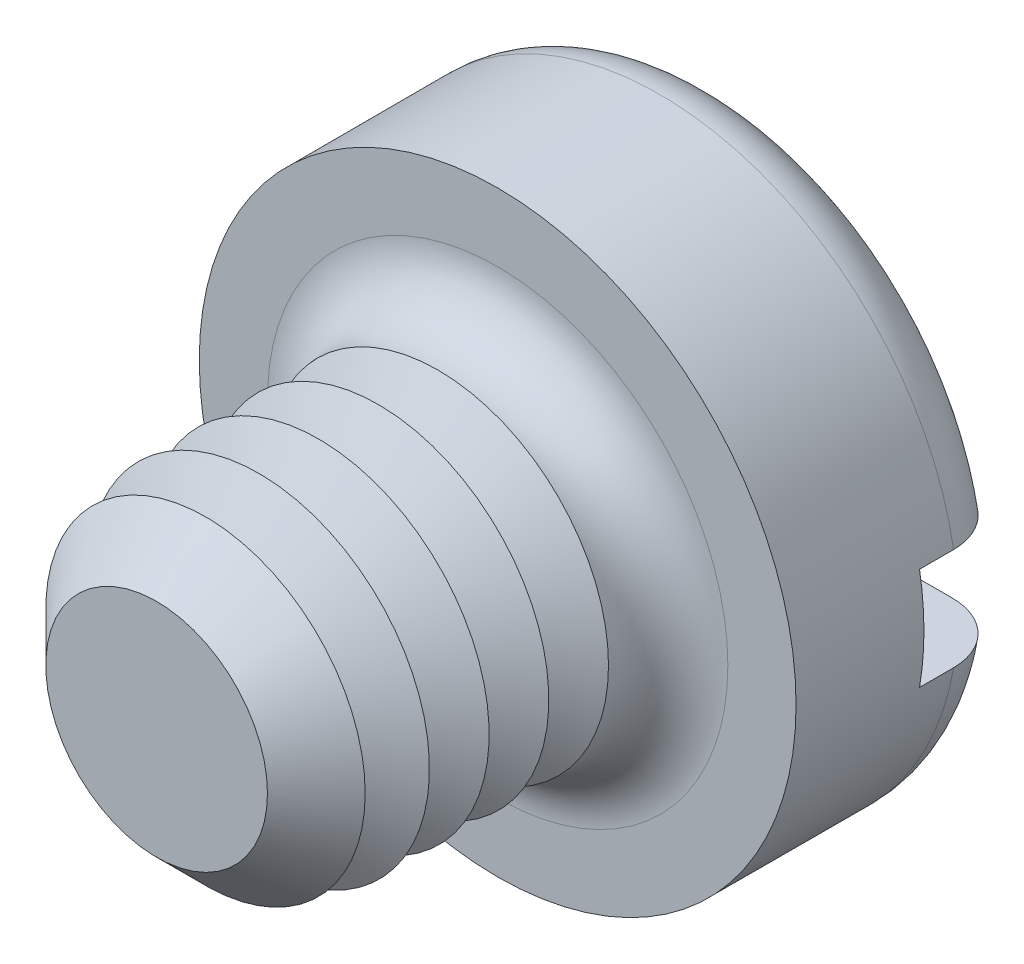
ISO-10303-21;
HEADER;
FILE_DESCRIPTION(('STEP AP214'),'2;1');
FILE_NAME('part.step','',(''),(''),'','','');
FILE_SCHEMA(('AUTOMOTIVE_DESIGN { 1 0 10303 214 1 1 1 1 }'));
ENDSEC;
DATA;
#1=APPLICATION_CONTEXT('core data for automotive mechanical design processes');
#2=APPLICATION_PROTOCOL_DEFINITION('international standard','automotive_design',2000,#1);
#3=PRODUCT_CONTEXT('',#1,'mechanical');
#4=PRODUCT('Part','Part','',(#3));
#5=PRODUCT_RELATED_PRODUCT_CATEGORY('part','',(#4));
#6=PRODUCT_DEFINITION_FORMATION('','',#4);
#7=PRODUCT_DEFINITION_CONTEXT('part definition',#1,'design');
#8=PRODUCT_DEFINITION('design','',#6,#7);
#9=PRODUCT_DEFINITION_SHAPE('','',#8);
#10=(LENGTH_UNIT() NAMED_UNIT(*) SI_UNIT(.MILLI.,.METRE.));
#11=(NAMED_UNIT(*) PLANE_ANGLE_UNIT() SI_UNIT($,.RADIAN.));
#12=(NAMED_UNIT(*) SI_UNIT($,.STERADIAN.) SOLID_ANGLE_UNIT());
#13=UNCERTAINTY_MEASURE_WITH_UNIT(LENGTH_MEASURE(1.E-05),#10,'distance_accuracy_value','');
#14=(GEOMETRIC_REPRESENTATION_CONTEXT(3) GLOBAL_UNCERTAINTY_ASSIGNED_CONTEXT((#13)) GLOBAL_UNIT_ASSIGNED_CONTEXT((#10,
#11,#12)) REPRESENTATION_CONTEXT('',''));
#15=CARTESIAN_POINT('',(0.,0.,0.));
#16=DIRECTION('',(0.,0.,1.));
#17=DIRECTION('',(1.,0.,0.));
#18=AXIS2_PLACEMENT_3D('',#15,#16,#17);
#19=CARTESIAN_POINT('',(0.,0.,-2.6));
#20=DIRECTION('',(0.,0.,1.));
#21=DIRECTION('',(1.,0.,0.));
#22=AXIS2_PLACEMENT_3D('',#19,#20,#21);
#23=PLANE('',#22);
#24=CARTESIAN_POINT('',(0.,0.,-2.6));
#25=DIRECTION('',(0.,0.,1.));
#26=DIRECTION('',(1.,0.,0.));
#27=AXIS2_PLACEMENT_3D('',#24,#25,#26);
#28=CIRCLE('',#27,2.8);
#29=CARTESIAN_POINT('',(-2.73495886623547,0.6,-2.6));
#30=VERTEX_POINT('',#29);
#31=CARTESIAN_POINT('',(2.73495886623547,0.6,-2.6));
#32=VERTEX_POINT('',#31);
#33=EDGE_CURVE('E116',#30,#32,#28,.F.);
#34=ORIENTED_EDGE('',*,*,#33,.T.);
#35=DIRECTION('',(1.,0.,0.));
#36=VECTOR('',#35,1.);
#37=CARTESIAN_POINT('',(-3.5,0.6,-2.6));
#38=LINE('',#37,#36);
#39=EDGE_CURVE('E111',#30,#32,#38,.T.);
#40=ORIENTED_EDGE('',*,*,#39,.F.);
#41=EDGE_LOOP('',(#34,#40));
#42=FACE_BOUND('',#41,.T.);
#43=ADVANCED_FACE('F39',(#42),#23,.F.);
#44=CARTESIAN_POINT('',(0.,0.,-1.9));
#45=DIRECTION('',(0.,0.,1.));
#46=DIRECTION('',(1.,0.,0.));
#47=AXIS2_PLACEMENT_3D('',#44,#45,#46);
#48=TOROIDAL_SURFACE('',#47,2.8,0.7);
#49=CARTESIAN_POINT('',(-3.24550494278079,0.6,-2.38938679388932));
#50=CARTESIAN_POINT('',(-3.21724139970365,0.6,-2.41780774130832));
#51=CARTESIAN_POINT('',(-3.18652103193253,0.6,-2.44383169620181));
#52=CARTESIAN_POINT('',(-3.12110229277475,0.6,-2.49034599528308));
#53=CARTESIAN_POINT('',(-3.08639834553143,0.6,-2.51082844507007));
#54=CARTESIAN_POINT('',(-3.01410013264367,0.6,-2.54568075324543));
#55=CARTESIAN_POINT('',(-2.97650963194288,0.6,-2.56005841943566));
#56=CARTESIAN_POINT('',(-2.89948250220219,0.6,-2.58239238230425));
#57=CARTESIAN_POINT('',(-2.86004633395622,0.6,-2.59035027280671));
#58=CARTESIAN_POINT('',(-2.77983715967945,0.6,-2.5997577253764));
#59=CARTESIAN_POINT('',(-2.73905311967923,0.6,-2.60111317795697));
#60=CARTESIAN_POINT('',(-2.65781876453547,0.6,-2.59706866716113));
#61=CARTESIAN_POINT('',(-2.61736849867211,0.6,-2.59166772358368));
#62=CARTESIAN_POINT('',(-2.53729983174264,0.6,-2.57414594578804));
#63=CARTESIAN_POINT('',(-2.49770360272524,0.6,-2.56192363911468));
#64=CARTESIAN_POINT('',(-2.421111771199,0.6,-2.5310238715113));
#65=CARTESIAN_POINT('',(-2.38411632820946,0.6,-2.51234601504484));
#66=CARTESIAN_POINT('',(-2.31371213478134,0.6,-2.46896762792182));
#67=CARTESIAN_POINT('',(-2.28031240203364,0.6,-2.44425244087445));
#68=CARTESIAN_POINT('',(-2.21823311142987,0.6,-2.38946667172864));
#69=CARTESIAN_POINT('',(-2.18955321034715,0.6,-2.35939647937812));
#70=CARTESIAN_POINT('',(-2.13836074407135,0.6,-2.29532787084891));
#71=CARTESIAN_POINT('',(-2.11574147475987,0.6,-2.26141482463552));
#72=CARTESIAN_POINT('',(-2.07677080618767,0.6,-2.19015935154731));
#73=CARTESIAN_POINT('',(-2.06041784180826,0.6,-2.15281778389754));
#74=CARTESIAN_POINT('',(-2.03508596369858,0.6,-2.07723332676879));
#75=CARTESIAN_POINT('',(-2.02585871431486,0.6,-2.03907365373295));
#76=CARTESIAN_POINT('',(-2.01416722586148,0.6,-1.96173417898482));
#77=CARTESIAN_POINT('',(-2.01170151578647,0.6,-1.92255460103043));
#78=CARTESIAN_POINT('',(-2.01359934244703,0.6,-1.84555709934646));
#79=CARTESIAN_POINT('',(-2.01775787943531,0.6,-1.80773393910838));
#80=CARTESIAN_POINT('',(-2.03236373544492,0.6,-1.73332511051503));
#81=CARTESIAN_POINT('',(-2.04281097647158,0.6,-1.69673942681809));
#82=CARTESIAN_POINT('',(-2.06962963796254,0.6,-1.62577336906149));
#83=CARTESIAN_POINT('',(-2.08600685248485,0.6,-1.59139519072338));
#84=CARTESIAN_POINT('',(-2.12413495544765,0.6,-1.52576356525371));
#85=CARTESIAN_POINT('',(-2.14588657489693,0.6,-1.49451054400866));
#86=CARTESIAN_POINT('',(-2.19483541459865,0.6,-1.43498643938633));
#87=CARTESIAN_POINT('',(-2.22217844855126,0.6,-1.40683532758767));
#88=CARTESIAN_POINT('',(-2.28105616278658,0.6,-1.35532544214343));
#89=CARTESIAN_POINT('',(-2.3125916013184,0.6,-1.33196753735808));
#90=CARTESIAN_POINT('',(-2.38018779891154,0.6,-1.28984356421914));
#91=CARTESIAN_POINT('',(-2.41637068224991,0.6,-1.27127330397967));
#92=CARTESIAN_POINT('',(-2.49129688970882,0.6,-1.24032971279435));
#93=CARTESIAN_POINT('',(-2.53004053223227,0.6,-1.22795715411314));
#94=CARTESIAN_POINT('',(-2.6098393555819,0.6,-1.2095515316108));
#95=CARTESIAN_POINT('',(-2.65092550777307,0.6,-1.20365237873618));
#96=CARTESIAN_POINT('',(-2.7335069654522,0.6,-1.1988380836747));
#97=CARTESIAN_POINT('',(-2.7750022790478,0.6,-1.19992308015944));
#98=CARTESIAN_POINT('',(-2.85718851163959,0.6,-1.20909046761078));
#99=CARTESIAN_POINT('',(-2.8978799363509,0.6,-1.21716830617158));
#100=CARTESIAN_POINT('',(-2.97729176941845,0.6,-1.24014327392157));
#101=CARTESIAN_POINT('',(-3.01601231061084,0.6,-1.25503994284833));
#102=CARTESIAN_POINT('',(-3.08976822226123,0.6,-1.29101066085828));
#103=CARTESIAN_POINT('',(-3.12484927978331,0.6,-1.31199098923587));
#104=CARTESIAN_POINT('',(-3.19090022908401,0.6,-1.35965144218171));
#105=CARTESIAN_POINT('',(-3.22187053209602,0.6,-1.38633099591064));
#106=CARTESIAN_POINT('',(-3.2781946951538,0.6,-1.44408564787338));
#107=CARTESIAN_POINT('',(-3.3036441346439,0.6,-1.47506754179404));
#108=CARTESIAN_POINT('',(-3.34887649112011,0.6,-1.54092398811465));
#109=CARTESIAN_POINT('',(-3.36865993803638,0.6,-1.57579817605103));
#110=CARTESIAN_POINT('',(-3.40166738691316,0.6,-1.64783067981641));
#111=CARTESIAN_POINT('',(-3.41499360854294,0.6,-1.68494217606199));
#112=CARTESIAN_POINT('',(-3.43515375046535,0.6,-1.76088675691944));
#113=CARTESIAN_POINT('',(-3.44198836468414,0.6,-1.79971965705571));
#114=CARTESIAN_POINT('',(-3.44891916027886,0.6,-1.87757893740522));
#115=CARTESIAN_POINT('',(-3.44908375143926,0.6,-1.91659924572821));
#116=CARTESIAN_POINT('',(-3.44284111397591,0.6,-1.99412088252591));
#117=CARTESIAN_POINT('',(-3.43643236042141,0.6,-2.03262208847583));
#118=CARTESIAN_POINT('',(-3.41725803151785,0.6,-2.10792315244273));
#119=CARTESIAN_POINT('',(-3.40450469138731,0.6,-2.14472613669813));
#120=CARTESIAN_POINT('',(-3.3730385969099,0.6,-2.21565060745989));
#121=CARTESIAN_POINT('',(-3.35433321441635,0.6,-2.24977534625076));
#122=CARTESIAN_POINT('',(-3.3201892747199,0.6,-2.30136364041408));
#123=CARTESIAN_POINT('',(-3.30647805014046,0.6,-2.31999402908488));
#124=CARTESIAN_POINT('',(-3.27728518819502,0.6,-2.35581090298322));
#125=CARTESIAN_POINT('',(-3.26180356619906,0.6,-2.37299740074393));
#126=CARTESIAN_POINT('',(-3.24550494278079,0.6,-2.38938679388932));
#127=B_SPLINE_CURVE_WITH_KNOTS('',3,(#49,#50,#51,#52,#53,#54,#55,#56,#57,#58,#59,#60,#61,#62,
#63,#64,#65,#66,#67,#68,#69,#70,#71,#72,#73,#74,#75,#76,#77,#78,#79,#80,#81,#82,#83,#84,#85,#86,
#87,#88,#89,#90,#91,#92,#93,#94,#95,#96,#97,#98,#99,#100,#101,#102,#103,#104,#105,#106,#107,
#108,#109,#110,#111,#112,#113,#114,#115,#116,#117,#118,#119,#120,#121,#122,#123,#124,#125,#126),
.UNSPECIFIED.,.T.,.F.,(4,2,2,2,2,2,2,2,2,2,2,2,2,2,2,2,2,2,2,2,2,2,2,2,2,2,2,2,2,2,2,2,2,2,2,2,
2,2,4),(0.,0.120160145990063,0.240490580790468,0.36066665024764,0.480812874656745,
0.602666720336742,0.724538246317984,0.848272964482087,0.972015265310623,1.09606100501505,
1.2200977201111,1.34178071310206,1.46343329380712,1.58062647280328,1.6977941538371,
1.81140573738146,1.92501591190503,2.03873739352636,2.15247435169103,2.26967910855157,
2.38690509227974,2.50835551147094,2.62982106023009,2.75375450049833,2.87769040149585,
3.00154567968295,3.12539259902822,3.24742469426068,3.36944457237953,3.48914477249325,
3.60883377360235,3.72656056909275,3.84427477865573,3.96078136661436,4.07731498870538,
4.19362474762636,4.3097910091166,4.37908387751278,4.44837614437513),.UNSPECIFIED.);
#128=CARTESIAN_POINT('',(-3.44818792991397,0.6,-1.8999999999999));
#129=VERTEX_POINT('',#128);
#130=EDGE_CURVE('E216',#129,#30,#127,.T.);
#131=ORIENTED_EDGE('',*,*,#130,.F.);
#132=CARTESIAN_POINT('',(0.,0.,-1.9));
#133=DIRECTION('',(0.,0.,1.));
#134=DIRECTION('',(1.,0.,0.));
#135=AXIS2_PLACEMENT_3D('',#132,#133,#134);
#136=CIRCLE('',#135,3.5);
#137=CARTESIAN_POINT('',(3.44818792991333,0.6,-1.9));
#138=VERTEX_POINT('',#137);
#139=EDGE_CURVE('E124',#138,#129,#136,.T.);
#140=ORIENTED_EDGE('',*,*,#139,.F.);
#141=CARTESIAN_POINT('',(2.1414268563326,0.6,-2.29762171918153));
#142=CARTESIAN_POINT('',(2.16505443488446,0.6,-2.33058245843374));
#143=CARTESIAN_POINT('',(2.19155609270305,0.6,-2.36152717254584));
#144=CARTESIAN_POINT('',(2.24942944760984,0.6,-2.41852964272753));
#145=CARTESIAN_POINT('',(2.28080921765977,0.6,-2.44457913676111));
#146=CARTESIAN_POINT('',(2.34741203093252,0.6,-2.49105381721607));
#147=CARTESIAN_POINT('',(2.38262862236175,0.6,-2.51148824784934));
#148=CARTESIAN_POINT('',(2.45593176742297,0.6,-2.54626881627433));
#149=CARTESIAN_POINT('',(2.49401741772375,0.6,-2.56061686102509));
#150=CARTESIAN_POINT('',(2.57272605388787,0.6,-2.58306429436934));
#151=CARTESIAN_POINT('',(2.6133821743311,0.6,-2.59104769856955));
#152=CARTESIAN_POINT('',(2.6954618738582,0.6,-2.60009608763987));
#153=CARTESIAN_POINT('',(2.73688552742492,0.6,-2.60116039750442));
#154=CARTESIAN_POINT('',(2.81941950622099,0.6,-2.5962925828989));
#155=CARTESIAN_POINT('',(2.86052888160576,0.6,-2.59034422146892));
#156=CARTESIAN_POINT('',(2.94113709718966,0.6,-2.57153687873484));
#157=CARTESIAN_POINT('',(2.98063603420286,0.6,-2.55867831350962));
#158=CARTESIAN_POINT('',(3.05633735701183,0.6,-2.52657771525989));
#159=CARTESIAN_POINT('',(3.09257627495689,0.6,-2.50742188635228));
#160=CARTESIAN_POINT('',(3.16123898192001,0.6,-2.46318606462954));
#161=CARTESIAN_POINT('',(3.19366316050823,0.6,-2.4381066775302));
#162=CARTESIAN_POINT('',(3.25312278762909,0.6,-2.38324481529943));
#163=CARTESIAN_POINT('',(3.28024842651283,0.6,-2.35356008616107));
#164=CARTESIAN_POINT('',(3.32902587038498,0.6,-2.28998971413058));
#165=CARTESIAN_POINT('',(3.35067820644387,0.6,-2.25610447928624));
#166=CARTESIAN_POINT('',(3.38751207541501,0.6,-2.18572286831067));
#167=CARTESIAN_POINT('',(3.40279804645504,0.6,-2.14928112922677));
#168=CARTESIAN_POINT('',(3.42695590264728,0.6,-2.07433042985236));
#169=CARTESIAN_POINT('',(3.43582824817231,0.6,-2.03582161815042));
#170=CARTESIAN_POINT('',(3.44682113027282,0.6,-1.95829536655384));
#171=CARTESIAN_POINT('',(3.44901648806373,0.6,-1.91928851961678));
#172=CARTESIAN_POINT('',(3.44680085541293,0.6,-1.84146366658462));
#173=CARTESIAN_POINT('',(3.44239008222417,0.6,-1.80264565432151));
#174=CARTESIAN_POINT('',(3.42712544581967,0.6,-1.72644634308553));
#175=CARTESIAN_POINT('',(3.41629508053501,0.6,-1.6890603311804));
#176=CARTESIAN_POINT('',(3.38853757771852,0.6,-1.61662604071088));
#177=CARTESIAN_POINT('',(3.37161039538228,0.6,-1.58157777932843));
#178=CARTESIAN_POINT('',(3.33207798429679,0.6,-1.51464178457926));
#179=CARTESIAN_POINT('',(3.30944854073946,0.6,-1.48276835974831));
#180=CARTESIAN_POINT('',(3.2592165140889,0.6,-1.42321861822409));
#181=CARTESIAN_POINT('',(3.23161370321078,0.6,-1.3955424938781));
#182=CARTESIAN_POINT('',(3.17188519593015,0.6,-1.34481834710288));
#183=CARTESIAN_POINT('',(3.13971065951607,0.6,-1.32182785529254));
#184=CARTESIAN_POINT('',(3.07201123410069,0.6,-1.28147003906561));
#185=CARTESIAN_POINT('',(3.03648608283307,0.6,-1.26410315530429));
#186=CARTESIAN_POINT('',(2.962449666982,0.6,-1.2351645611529));
#187=CARTESIAN_POINT('',(2.92389781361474,0.6,-1.22369671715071));
#188=CARTESIAN_POINT('',(2.84543273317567,0.6,-1.20726565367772));
#189=CARTESIAN_POINT('',(2.80551936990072,0.6,-1.20230308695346));
#190=CARTESIAN_POINT('',(2.72467191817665,0.6,-1.1989357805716));
#191=CARTESIAN_POINT('',(2.68373266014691,0.6,-1.20065484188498));
#192=CARTESIAN_POINT('',(2.60270222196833,0.6,-1.21084560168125));
#193=CARTESIAN_POINT('',(2.56261112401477,0.6,-1.21931795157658));
#194=CARTESIAN_POINT('',(2.48385954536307,0.6,-1.24292934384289));
#195=CARTESIAN_POINT('',(2.44522508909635,0.6,-1.25815531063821));
#196=CARTESIAN_POINT('',(2.37106165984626,0.6,-1.29488663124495));
#197=CARTESIAN_POINT('',(2.33553282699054,0.6,-1.31639226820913));
#198=CARTESIAN_POINT('',(2.2686996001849,0.6,-1.36507949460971));
#199=CARTESIAN_POINT('',(2.23738745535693,0.6,-1.39225042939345));
#200=CARTESIAN_POINT('',(2.17990424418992,0.6,-1.45157941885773));
#201=CARTESIAN_POINT('',(2.15373259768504,0.6,-1.48373691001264));
#202=CARTESIAN_POINT('',(2.10799355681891,0.6,-1.551327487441));
#203=CARTESIAN_POINT('',(2.08828258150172,0.6,-1.58666329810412));
#204=CARTESIAN_POINT('',(2.05534440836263,0.6,-1.66023600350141));
#205=CARTESIAN_POINT('',(2.042115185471,0.6,-1.6984719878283));
#206=CARTESIAN_POINT('',(2.02303126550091,0.6,-1.77519783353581));
#207=CARTESIAN_POINT('',(2.01691541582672,0.6,-1.8136228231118));
#208=CARTESIAN_POINT('',(2.01140375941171,0.6,-1.89096056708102));
#209=CARTESIAN_POINT('',(2.01200856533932,0.6,-1.92987336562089));
#210=CARTESIAN_POINT('',(2.01981617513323,0.6,-2.006065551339));
#211=CARTESIAN_POINT('',(2.02685835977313,0.6,-2.04336165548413));
#212=CARTESIAN_POINT('',(2.0470502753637,0.6,-2.1162250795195));
#213=CARTESIAN_POINT('',(2.06019252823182,0.6,-2.15179445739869));
#214=CARTESIAN_POINT('',(2.08525738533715,0.6,-2.20558874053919));
#215=CARTESIAN_POINT('',(2.09529161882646,0.6,-2.22471751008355));
#216=CARTESIAN_POINT('',(2.11708813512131,0.6,-2.26196179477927));
#217=CARTESIAN_POINT('',(2.12885034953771,0.6,-2.28007734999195));
#218=CARTESIAN_POINT('',(2.1414268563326,0.6,-2.29762171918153));
#219=B_SPLINE_CURVE_WITH_KNOTS('',3,(#141,#142,#143,#144,#145,#146,#147,#148,#149,#150,#151,
#152,#153,#154,#155,#156,#157,#158,#159,#160,#161,#162,#163,#164,#165,#166,#167,#168,#169,#170,
#171,#172,#173,#174,#175,#176,#177,#178,#179,#180,#181,#182,#183,#184,#185,#186,#187,#188,#189,
#190,#191,#192,#193,#194,#195,#196,#197,#198,#199,#200,#201,#202,#203,#204,#205,#206,#207,#208,
#209,#210,#211,#212,#213,#214,#215,#216,#217,#218),.UNSPECIFIED.,.T.,.F.,(4,2,2,2,2,2,2,2,2,2,2,
2,2,2,2,2,2,2,2,2,2,2,2,2,2,2,2,2,2,2,2,2,2,2,2,2,2,2,4),(0.,0.121582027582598,0.24336745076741,
0.364951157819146,0.486496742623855,0.610209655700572,0.73393463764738,0.857946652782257,
0.981951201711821,1.1043243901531,1.22668507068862,1.34673532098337,1.46677391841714,
1.58475736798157,1.70273234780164,1.81938035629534,1.93602452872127,2.05224435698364,
2.168465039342,2.28518782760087,2.40191596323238,2.52000081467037,2.6380949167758,
2.75820270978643,2.87832255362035,3.00067856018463,3.1230463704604,3.24703703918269,
3.37103329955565,3.49479843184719,3.6185495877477,3.73932715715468,3.86006696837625,
3.9762182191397,4.09238005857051,4.2057203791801,4.31892212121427,4.38364046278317,
4.44835624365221),.UNSPECIFIED.);
#220=EDGE_CURVE('E218',#32,#138,#219,.T.);
#221=ORIENTED_EDGE('',*,*,#220,.F.);
#222=ORIENTED_EDGE('',*,*,#33,.F.);
#223=EDGE_LOOP('',(#131,#140,#221,#222));
#224=FACE_BOUND('',#223,.T.);
#225=ADVANCED_FACE('F200',(#224),#48,.T.);
#226=CARTESIAN_POINT('',(0.,0.,-2.6));
#227=DIRECTION('',(0.,0.,1.));
#228=DIRECTION('',(1.,0.,0.));
#229=AXIS2_PLACEMENT_3D('',#226,#227,#228);
#230=CYLINDRICAL_SURFACE('',#229,3.5);
#231=DIRECTION('',(0.,0.,1.));
#232=VECTOR('',#231,1.);
#233=CARTESIAN_POINT('',(3.44818792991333,0.6,-2.6));
#234=LINE('',#233,#232);
#235=CARTESIAN_POINT('',(3.44818792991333,0.6,-1.5));
#236=VERTEX_POINT('',#235);
#237=EDGE_CURVE('E231',#138,#236,#234,.T.);
#238=ORIENTED_EDGE('',*,*,#237,.F.);
#239=ORIENTED_EDGE('',*,*,#139,.T.);
#240=DIRECTION('',(0.,0.,1.));
#241=VECTOR('',#240,1.);
#242=CARTESIAN_POINT('',(-3.44818792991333,0.6,-2.6));
#243=LINE('',#242,#241);
#244=CARTESIAN_POINT('',(-3.44818792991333,0.6,-1.5));
#245=VERTEX_POINT('',#244);
#246=EDGE_CURVE('E63',#245,#129,#243,.F.);
#247=ORIENTED_EDGE('',*,*,#246,.F.);
#248=CARTESIAN_POINT('',(0.,0.,-1.5));
#249=DIRECTION('',(0.,0.,-1.));
#250=DIRECTION('',(-1.,0.,0.));
#251=AXIS2_PLACEMENT_3D('',#248,#249,#250);
#252=CIRCLE('',#251,3.5);
#253=CARTESIAN_POINT('',(-3.44818792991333,-0.599999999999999,-1.5));
#254=VERTEX_POINT('',#253);
#255=EDGE_CURVE('E43',#245,#254,#252,.F.);
#256=ORIENTED_EDGE('',*,*,#255,.T.);
#257=DIRECTION('',(0.,0.,1.));
#258=VECTOR('',#257,1.);
#259=CARTESIAN_POINT('',(-3.44818792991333,-0.6,-2.6));
#260=LINE('',#259,#258);
#261=CARTESIAN_POINT('',(-3.44818792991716,-0.6,-1.90000000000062));
#262=VERTEX_POINT('',#261);
#263=EDGE_CURVE('E228',#262,#254,#260,.T.);
#264=ORIENTED_EDGE('',*,*,#263,.F.);
#265=CARTESIAN_POINT('',(3.44818792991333,-0.600000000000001,-1.9));
#266=VERTEX_POINT('',#265);
#267=EDGE_CURVE('E126',#262,#266,#136,.T.);
#268=ORIENTED_EDGE('',*,*,#267,.T.);
#269=DIRECTION('',(0.,0.,1.));
#270=VECTOR('',#269,1.);
#271=CARTESIAN_POINT('',(3.44818792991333,-0.600000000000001,-2.6));
#272=LINE('',#271,#270);
#273=CARTESIAN_POINT('',(3.44818792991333,-0.6,-1.5));
#274=VERTEX_POINT('',#273);
#275=EDGE_CURVE('E55',#274,#266,#272,.F.);
#276=ORIENTED_EDGE('',*,*,#275,.F.);
#277=EDGE_CURVE('E11',#274,#236,#252,.F.);
#278=ORIENTED_EDGE('',*,*,#277,.T.);
#279=EDGE_LOOP('',(#238,#239,#247,#256,#264,#268,#276,#278));
#280=FACE_BOUND('',#279,.T.);
#281=CARTESIAN_POINT('',(0.,0.,0.));
#282=DIRECTION('',(0.,0.,1.));
#283=DIRECTION('',(1.,0.,0.));
#284=AXIS2_PLACEMENT_3D('',#281,#282,#283);
#285=CIRCLE('',#284,3.5);
#286=CARTESIAN_POINT('',(3.5,0.,0.));
#287=VERTEX_POINT('',#286);
#288=EDGE_CURVE('E234',#287,#287,#285,.T.);
#289=ORIENTED_EDGE('',*,*,#288,.F.);
#290=EDGE_LOOP('',(#289));
#291=FACE_BOUND('',#290,.T.);
#292=ADVANCED_FACE('F196',(#280,#291),#230,.T.);
#293=CARTESIAN_POINT('',(2.73495886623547,-0.6,-2.6));
#294=VERTEX_POINT('',#293);
#295=CARTESIAN_POINT('',(-2.73495886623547,-0.6,-2.6));
#296=VERTEX_POINT('',#295);
#297=EDGE_CURVE('E109',#294,#296,#28,.F.);
#298=ORIENTED_EDGE('',*,*,#297,.T.);
#299=DIRECTION('',(-1.,0.,0.));
#300=VECTOR('',#299,1.);
#301=CARTESIAN_POINT('',(-3.5,-0.6,-2.6));
#302=LINE('',#301,#300);
#303=EDGE_CURVE('E96',#294,#296,#302,.T.);
#304=ORIENTED_EDGE('',*,*,#303,.F.);
#305=EDGE_LOOP('',(#298,#304));
#306=FACE_BOUND('',#305,.T.);
#307=ADVANCED_FACE('F108',(#306),#23,.F.);
#308=CARTESIAN_POINT('',(0.,0.,0.));
#309=DIRECTION('',(0.,0.,1.));
#310=DIRECTION('',(1.,0.,0.));
#311=AXIS2_PLACEMENT_3D('',#308,#309,#310);
#312=PLANE('',#311);
#313=CARTESIAN_POINT('',(0.,0.,0.));
#314=DIRECTION('',(0.,0.,1.));
#315=DIRECTION('',(1.,0.,0.));
#316=AXIS2_PLACEMENT_3D('',#313,#314,#315);
#317=CIRCLE('',#316,2.7);
#318=CARTESIAN_POINT('',(2.7,0.,0.));
#319=VERTEX_POINT('',#318);
#320=EDGE_CURVE('E115',#319,#319,#317,.F.);
#321=ORIENTED_EDGE('',*,*,#320,.T.);
#322=EDGE_LOOP('',(#321));
#323=FACE_BOUND('',#322,.T.);
#324=ORIENTED_EDGE('',*,*,#288,.T.);
#325=EDGE_LOOP('',(#324));
#326=FACE_BOUND('',#325,.T.);
#327=ADVANCED_FACE('F195',(#323,#326),#312,.T.);
#328=CARTESIAN_POINT('',(-3.24550494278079,-0.6,-2.38938679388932));
#329=CARTESIAN_POINT('',(-3.27309693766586,-0.6,-2.36163611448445));
#330=CARTESIAN_POINT('',(-3.29838741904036,-0.6,-2.3315608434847));
#331=CARTESIAN_POINT('',(-3.34359429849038,-0.6,-2.26757659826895));
#332=CARTESIAN_POINT('',(-3.36350518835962,-0.6,-2.23366374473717));
#333=CARTESIAN_POINT('',(-3.39733065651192,-0.6,-2.16296274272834));
#334=CARTESIAN_POINT('',(-3.4112451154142,-0.6,-2.12617453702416));
#335=CARTESIAN_POINT('',(-3.43264462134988,-0.6,-2.05078178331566));
#336=CARTESIAN_POINT('',(-3.44013114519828,-0.6,-2.01217765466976));
#337=CARTESIAN_POINT('',(-3.44841975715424,-0.6,-1.9345391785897));
#338=CARTESIAN_POINT('',(-3.44926944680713,-0.6,-1.89550990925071));
#339=CARTESIAN_POINT('',(-3.44438358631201,-0.6,-1.81786552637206));
#340=CARTESIAN_POINT('',(-3.43864801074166,-0.6,-1.77925041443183));
#341=CARTESIAN_POINT('',(-3.42079221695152,-0.6,-1.70364264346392));
#342=CARTESIAN_POINT('',(-3.40869011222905,-0.6,-1.66664570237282));
#343=CARTESIAN_POINT('',(-3.37847692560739,-0.6,-1.59519424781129));
#344=CARTESIAN_POINT('',(-3.3603657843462,-0.6,-1.56073975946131));
#345=CARTESIAN_POINT('',(-3.31856549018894,-0.6,-1.4951524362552));
#346=CARTESIAN_POINT('',(-3.29484830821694,-0.6,-1.46403747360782));
#347=CARTESIAN_POINT('',(-3.24258489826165,-0.6,-1.40617131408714));
#348=CARTESIAN_POINT('',(-3.21403843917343,-0.6,-1.37942032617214));
#349=CARTESIAN_POINT('',(-3.15256084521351,-0.6,-1.33067963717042));
#350=CARTESIAN_POINT('',(-3.11958015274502,-0.6,-1.30875246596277));
#351=CARTESIAN_POINT('',(-3.0504559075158,-0.6,-1.27063718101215));
#352=CARTESIAN_POINT('',(-3.01431209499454,-0.6,-1.25444953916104));
#353=CARTESIAN_POINT('',(-2.93921710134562,-0.6,-1.22796796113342));
#354=CARTESIAN_POINT('',(-2.90022796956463,-0.6,-1.217781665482));
#355=CARTESIAN_POINT('',(-2.82110512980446,-0.6,-1.20396915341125));
#356=CARTESIAN_POINT('',(-2.7809713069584,-0.6,-1.2003435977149));
#357=CARTESIAN_POINT('',(-2.69990924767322,-0.6,-1.19969717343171));
#358=CARTESIAN_POINT('',(-2.65898001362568,-0.6,-1.20279937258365));
#359=CARTESIAN_POINT('',(-2.57819986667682,-0.6,-1.21574287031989));
#360=CARTESIAN_POINT('',(-2.53834905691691,-0.6,-1.22558481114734));
#361=CARTESIAN_POINT('',(-2.46035232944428,-0.6,-1.25189361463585));
#362=CARTESIAN_POINT('',(-2.42223314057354,-0.6,-1.2684398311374));
#363=CARTESIAN_POINT('',(-2.34932316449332,-0.6,-1.30771928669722));
#364=CARTESIAN_POINT('',(-2.31453248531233,-0.6,-1.33045272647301));
#365=CARTESIAN_POINT('',(-2.24945577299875,-0.6,-1.38141543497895));
#366=CARTESIAN_POINT('',(-2.21915255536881,-0.6,-1.40962272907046));
#367=CARTESIAN_POINT('',(-2.16386461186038,-0.6,-1.47084552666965));
#368=CARTESIAN_POINT('',(-2.13887916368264,-0.6,-1.50386037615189));
#369=CARTESIAN_POINT('',(-2.09568071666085,-0.6,-1.57285917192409));
#370=CARTESIAN_POINT('',(-2.07730739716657,-0.6,-1.60874263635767));
#371=CARTESIAN_POINT('',(-2.04712019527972,-0.6,-1.68316975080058));
#372=CARTESIAN_POINT('',(-2.03530452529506,-0.6,-1.72171267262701));
#373=CARTESIAN_POINT('',(-2.01901751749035,-0.6,-1.79878952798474));
#374=CARTESIAN_POINT('',(-2.01428434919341,-0.6,-1.8372682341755));
#375=CARTESIAN_POINT('',(-2.01150652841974,-0.6,-1.91446369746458));
#376=CARTESIAN_POINT('',(-2.01346084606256,-0.6,-1.95318041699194));
#377=CARTESIAN_POINT('',(-2.02386268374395,-0.6,-2.0288619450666));
#378=CARTESIAN_POINT('',(-2.03216724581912,-0.6,-2.06584654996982));
#379=CARTESIAN_POINT('',(-2.05479337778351,-0.6,-2.13792373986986));
#380=CARTESIAN_POINT('',(-2.06911522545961,-0.6,-2.1730162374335));
#381=CARTESIAN_POINT('',(-2.10349906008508,-0.6,-2.24081034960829));
#382=CARTESIAN_POINT('',(-2.12363007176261,-0.6,-2.27347689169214));
#383=CARTESIAN_POINT('',(-2.16891308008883,-0.6,-2.33511902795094));
#384=CARTESIAN_POINT('',(-2.19406590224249,-0.6,-2.36409401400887));
#385=CARTESIAN_POINT('',(-2.24962389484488,-0.6,-2.41861972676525));
#386=CARTESIAN_POINT('',(-2.28018314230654,-0.6,-2.44401345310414));
#387=CARTESIAN_POINT('',(-2.34501720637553,-0.6,-2.48950558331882));
#388=CARTESIAN_POINT('',(-2.37929266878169,-0.6,-2.50960306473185));
#389=CARTESIAN_POINT('',(-2.45179417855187,-0.6,-2.54458276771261));
#390=CARTESIAN_POINT('',(-2.49011248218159,-0.6,-2.55927401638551));
#391=CARTESIAN_POINT('',(-2.56865227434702,-0.6,-2.58211133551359));
#392=CARTESIAN_POINT('',(-2.60887386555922,-0.6,-2.59025705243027));
#393=CARTESIAN_POINT('',(-2.69064746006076,-0.6,-2.59982905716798));
#394=CARTESIAN_POINT('',(-2.73220999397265,-0.6,-2.60116580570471));
#395=CARTESIAN_POINT('',(-2.81497658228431,-0.6,-2.59679700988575));
#396=CARTESIAN_POINT('',(-2.85618055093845,-0.6,-2.59108982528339));
#397=CARTESIAN_POINT('',(-2.93677683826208,-0.6,-2.57279487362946));
#398=CARTESIAN_POINT('',(-2.97617834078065,-0.6,-2.56024753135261));
#399=CARTESIAN_POINT('',(-3.05222242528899,-0.6,-2.52860709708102));
#400=CARTESIAN_POINT('',(-3.08886850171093,-0.6,-2.50952247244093));
#401=CARTESIAN_POINT('',(-3.14562501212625,-0.6,-2.47340693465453));
#402=CARTESIAN_POINT('',(-3.16689358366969,-0.6,-2.45816337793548));
#403=CARTESIAN_POINT('',(-3.20761866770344,-0.6,-2.42542115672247));
#404=CARTESIAN_POINT('',(-3.22707520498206,-0.6,-2.40792252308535));
#405=CARTESIAN_POINT('',(-3.24550494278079,-0.6,-2.38938679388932));
#406=B_SPLINE_CURVE_WITH_KNOTS('',3,(#328,#329,#330,#331,#332,#333,#334,#335,#336,#337,#338,
#339,#340,#341,#342,#343,#344,#345,#346,#347,#348,#349,#350,#351,#352,#353,#354,#355,#356,#357,
#358,#359,#360,#361,#362,#363,#364,#365,#366,#367,#368,#369,#370,#371,#372,#373,#374,#375,#376,
#377,#378,#379,#380,#381,#382,#383,#384,#385,#386,#387,#388,#389,#390,#391,#392,#393,#394,#395,
#396,#397,#398,#399,#400,#401,#402,#403,#404,#405),.UNSPECIFIED.,.T.,.F.,(4,2,2,2,2,2,2,2,2,2,2,
2,2,2,2,2,2,2,2,2,2,2,2,2,2,2,2,2,2,2,2,2,2,2,2,2,2,2,4),(0.,0.117306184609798,
0.234732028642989,0.352160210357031,0.469561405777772,0.586119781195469,0.702678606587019,
0.818907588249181,0.935137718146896,1.05196174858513,1.1687913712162,1.2870562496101,
1.40533084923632,1.52566688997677,1.64601504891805,1.76858322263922,1.89116307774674,
2.01523830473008,2.13931755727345,2.26290863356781,2.38648291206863,2.50681878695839,
2.62712184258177,2.74285697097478,2.85857427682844,2.97176054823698,3.08495204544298,
3.19954814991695,3.31416310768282,3.43282436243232,3.55150627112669,3.67404987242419,
3.79660009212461,3.92075778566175,4.04494439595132,4.16840490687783,4.29170610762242,
4.3700604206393,4.44841366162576),.UNSPECIFIED.);
#407=EDGE_CURVE('E103',#296,#262,#406,.T.);
#408=ORIENTED_EDGE('',*,*,#407,.F.);
#409=ORIENTED_EDGE('',*,*,#297,.F.);
#410=CARTESIAN_POINT('',(2.1414268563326,-0.6,-2.29762171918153));
#411=CARTESIAN_POINT('',(2.11900044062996,-0.6,-2.26633119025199));
#412=CARTESIAN_POINT('',(2.09913154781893,-0.6,-2.23318080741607));
#413=CARTESIAN_POINT('',(2.06517900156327,-0.6,-2.16401111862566));
#414=CARTESIAN_POINT('',(2.05109968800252,-0.6,-2.12798968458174));
#415=CARTESIAN_POINT('',(2.02923593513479,-0.6,-2.05404277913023));
#416=CARTESIAN_POINT('',(2.02145692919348,-0.6,-2.01611569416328));
#417=CARTESIAN_POINT('',(2.01251710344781,-0.6,-1.93949649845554));
#418=CARTESIAN_POINT('',(2.01135461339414,-0.6,-1.90080458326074));
#419=CARTESIAN_POINT('',(2.01564803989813,-0.6,-1.82450508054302));
#420=CARTESIAN_POINT('',(2.02098305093,-0.6,-1.78689061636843));
#421=CARTESIAN_POINT('',(2.03786826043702,-0.6,-1.71308589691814));
#422=CARTESIAN_POINT('',(2.04941870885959,-0.6,-1.67689569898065));
#423=CARTESIAN_POINT('',(2.07838664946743,-0.6,-1.60676639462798));
#424=CARTESIAN_POINT('',(2.09582944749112,-0.6,-1.57283776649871));
#425=CARTESIAN_POINT('',(2.1359925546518,-0.6,-1.50826612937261));
#426=CARTESIAN_POINT('',(2.15871360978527,-0.6,-1.47762358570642));
#427=CARTESIAN_POINT('',(2.20955413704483,-0.6,-1.41943384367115));
#428=CARTESIAN_POINT('',(2.23782364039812,-0.6,-1.39201777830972));
#429=CARTESIAN_POINT('',(2.29842612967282,-0.6,-1.34212199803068));
#430=CARTESIAN_POINT('',(2.33075984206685,-0.6,-1.31964316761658));
#431=CARTESIAN_POINT('',(2.399806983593,-0.6,-1.27945238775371));
#432=CARTESIAN_POINT('',(2.43663466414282,-0.6,-1.26193653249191));
#433=CARTESIAN_POINT('',(2.51267241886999,-0.6,-1.23320660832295));
#434=CARTESIAN_POINT('',(2.55188277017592,-0.6,-1.22199327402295));
#435=CARTESIAN_POINT('',(2.63235000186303,-0.6,-1.20602688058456));
#436=CARTESIAN_POINT('',(2.673631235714,-0.6,-1.20139617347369));
#437=CARTESIAN_POINT('',(2.7563863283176,-0.6,-1.19914622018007));
#438=CARTESIAN_POINT('',(2.79786018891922,-0.6,-1.20152704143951));
#439=CARTESIAN_POINT('',(2.87971192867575,-0.6,-1.21326884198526));
#440=CARTESIAN_POINT('',(2.92009214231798,-0.6,-1.22261349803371));
#441=CARTESIAN_POINT('',(2.99866777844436,-0.6,-1.24805614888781));
#442=CARTESIAN_POINT('',(3.03686335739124,-0.600000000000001,-1.26415365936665));
#443=CARTESIAN_POINT('',(3.10934738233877,-0.600000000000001,-1.3023912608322));
#444=CARTESIAN_POINT('',(3.14368704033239,-0.600000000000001,-1.32443423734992));
#445=CARTESIAN_POINT('',(3.20808395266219,-0.600000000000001,-1.37407725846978));
#446=CARTESIAN_POINT('',(3.23814164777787,-0.600000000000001,-1.40167673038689));
#447=CARTESIAN_POINT('',(3.29251534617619,-0.600000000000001,-1.46108303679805));
#448=CARTESIAN_POINT('',(3.3169296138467,-0.600000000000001,-1.49279994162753));
#449=CARTESIAN_POINT('',(3.35998418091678,-0.600000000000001,-1.55993706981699));
#450=CARTESIAN_POINT('',(3.37862502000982,-0.600000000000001,-1.59535694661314));
#451=CARTESIAN_POINT('',(3.40930212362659,-0.600000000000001,-1.668283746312));
#452=CARTESIAN_POINT('',(3.42143897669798,-0.600000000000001,-1.70574837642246));
#453=CARTESIAN_POINT('',(3.43918305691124,-0.600000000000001,-1.78219297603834));
#454=CARTESIAN_POINT('',(3.44479069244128,-0.600000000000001,-1.82117285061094));
#455=CARTESIAN_POINT('',(3.44928173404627,-0.600000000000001,-1.89914596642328));
#456=CARTESIAN_POINT('',(3.44822835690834,-0.600000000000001,-1.93813558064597));
#457=CARTESIAN_POINT('',(3.43957811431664,-0.600000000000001,-2.0153811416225));
#458=CARTESIAN_POINT('',(3.43198139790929,-0.600000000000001,-2.05363710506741));
#459=CARTESIAN_POINT('',(3.41049386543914,-0.600000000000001,-2.12826741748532));
#460=CARTESIAN_POINT('',(3.39661362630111,-0.600000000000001,-2.16464481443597));
#461=CARTESIAN_POINT('',(3.36297924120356,-0.600000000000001,-2.23457274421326));
#462=CARTESIAN_POINT('',(3.34322499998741,-0.600000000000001,-2.26812323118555));
#463=CARTESIAN_POINT('',(3.29828706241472,-0.600000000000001,-2.33167864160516));
#464=CARTESIAN_POINT('',(3.27307040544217,-0.600000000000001,-2.36166024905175));
#465=CARTESIAN_POINT('',(3.21802069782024,-0.600000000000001,-2.41703165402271));
#466=CARTESIAN_POINT('',(3.18818738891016,-0.600000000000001,-2.44242119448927));
#467=CARTESIAN_POINT('',(3.12433871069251,-0.600000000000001,-2.48825551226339));
#468=CARTESIAN_POINT('',(3.09027338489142,-0.6,-2.50863067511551));
#469=CARTESIAN_POINT('',(3.01925175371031,-0.6,-2.54348754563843));
#470=CARTESIAN_POINT('',(2.982295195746,-0.6,-2.55796873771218));
#471=CARTESIAN_POINT('',(2.90583499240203,-0.6,-2.58090526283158));
#472=CARTESIAN_POINT('',(2.86629758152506,-0.6,-2.58924801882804));
#473=CARTESIAN_POINT('',(2.78639041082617,-0.6,-2.59930573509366));
#474=CARTESIAN_POINT('',(2.7460205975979,-0.6,-2.60102026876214));
#475=CARTESIAN_POINT('',(2.66482039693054,-0.6,-2.59779078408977));
#476=CARTESIAN_POINT('',(2.62399477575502,-0.6,-2.59272651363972));
#477=CARTESIAN_POINT('',(2.54373809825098,-0.6,-2.57588976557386));
#478=CARTESIAN_POINT('',(2.50430750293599,-0.6,-2.56411509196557));
#479=CARTESIAN_POINT('',(2.42753167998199,-0.6,-2.53401488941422));
#480=CARTESIAN_POINT('',(2.39021407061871,-0.6,-2.51561892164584));
#481=CARTESIAN_POINT('',(2.31925431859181,-0.6,-2.4727929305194));
#482=CARTESIAN_POINT('',(2.28560806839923,-0.6,-2.44836975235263));
#483=CARTESIAN_POINT('',(2.23316677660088,-0.6,-2.40295212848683));
#484=CARTESIAN_POINT('',(2.21309339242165,-0.6,-2.38341311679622));
#485=CARTESIAN_POINT('',(2.17537212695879,-0.6,-2.34211733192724));
#486=CARTESIAN_POINT('',(2.1577241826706,-0.6,-2.32036061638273));
#487=CARTESIAN_POINT('',(2.1414268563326,-0.6,-2.29762171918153));
#488=B_SPLINE_CURVE_WITH_KNOTS('',3,(#410,#411,#412,#413,#414,#415,#416,#417,#418,#419,#420,
#421,#422,#423,#424,#425,#426,#427,#428,#429,#430,#431,#432,#433,#434,#435,#436,#437,#438,#439,
#440,#441,#442,#443,#444,#445,#446,#447,#448,#449,#450,#451,#452,#453,#454,#455,#456,#457,#458,
#459,#460,#461,#462,#463,#464,#465,#466,#467,#468,#469,#470,#471,#472,#473,#474,#475,#476,#477,
#478,#479,#480,#481,#482,#483,#484,#485,#486,#487),.UNSPECIFIED.,.T.,.F.,(4,2,2,2,2,2,2,2,2,2,2,
2,2,2,2,2,2,2,2,2,2,2,2,2,2,2,2,2,2,2,2,2,2,2,2,2,2,2,4),(0.,0.115394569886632,
0.230875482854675,0.346455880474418,0.462007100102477,0.575440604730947,0.688878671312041,
0.802810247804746,0.91675793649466,1.03436780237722,1.15199872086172,1.27377854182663,
1.39557255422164,1.51960202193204,1.64363268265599,1.76737352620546,1.89110549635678,
2.01292743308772,2.13473682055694,2.25423121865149,2.37371444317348,2.49129215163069,
2.60886250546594,2.72531873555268,2.8417723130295,2.95803059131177,3.07429075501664,
3.19127301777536,3.30826182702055,3.42679321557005,3.54533497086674,3.66599996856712,
3.78667273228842,3.90951478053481,4.03239705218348,4.15662720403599,4.28071691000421,
4.36457658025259,4.44843407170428),.UNSPECIFIED.);
#489=EDGE_CURVE('E92',#266,#294,#488,.T.);
#490=ORIENTED_EDGE('',*,*,#489,.F.);
#491=ORIENTED_EDGE('',*,*,#267,.F.);
#492=EDGE_LOOP('',(#408,#409,#490,#491));
#493=FACE_BOUND('',#492,.T.);
#494=ADVANCED_FACE('F113',(#493),#48,.T.);
#495=CARTESIAN_POINT('',(0.,0.,0.7));
#496=DIRECTION('',(0.,0.,1.));
#497=DIRECTION('',(1.,0.,0.));
#498=AXIS2_PLACEMENT_3D('',#495,#496,#497);
#499=TOROIDAL_SURFACE('',#498,2.7,0.7);
#500=ORIENTED_EDGE('',*,*,#320,.F.);
#501=EDGE_LOOP('',(#500));
#502=FACE_BOUND('',#501,.T.);
#503=CARTESIAN_POINT('',(0.,0.,0.7));
#504=DIRECTION('',(0.,0.,-1.));
#505=DIRECTION('',(-1.,0.,0.));
#506=AXIS2_PLACEMENT_3D('',#503,#504,#505);
#507=CIRCLE('',#506,2.);
#508=CARTESIAN_POINT('',(-2.,0.,0.7));
#509=VERTEX_POINT('',#508);
#510=EDGE_CURVE('E238',#509,#509,#507,.T.);
#511=ORIENTED_EDGE('',*,*,#510,.T.);
#512=EDGE_LOOP('',(#511));
#513=FACE_BOUND('',#512,.T.);
#514=ADVANCED_FACE('F188',(#502,#513),#499,.F.);
#515=CARTESIAN_POINT('',(0.,0.,1.05));
#516=DIRECTION('',(0.,0.,-1.));
#517=DIRECTION('',(-1.,0.,0.));
#518=AXIS2_PLACEMENT_3D('',#515,#516,#517);
#519=CONICAL_SURFACE('',#518,1.39378221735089,1.0471975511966);
#520=ORIENTED_EDGE('',*,*,#510,.F.);
#521=EDGE_LOOP('',(#520));
#522=FACE_BOUND('',#521,.T.);
#523=CARTESIAN_POINT('',(0.,0.,1.05));
#524=DIRECTION('',(0.,0.,-1.));
#525=DIRECTION('',(-1.,0.,0.));
#526=AXIS2_PLACEMENT_3D('',#523,#524,#525);
#527=CIRCLE('',#526,1.39378221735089);
#528=CARTESIAN_POINT('',(-1.39378221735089,0.,1.05));
#529=VERTEX_POINT('',#528);
#530=EDGE_CURVE('E244',#529,#529,#527,.T.);
#531=ORIENTED_EDGE('',*,*,#530,.T.);
#532=EDGE_LOOP('',(#531));
#533=FACE_BOUND('',#532,.T.);
#534=ADVANCED_FACE('F184',(#522,#533),#519,.T.);
#535=CARTESIAN_POINT('',(0.,0.,1.4));
#536=DIRECTION('',(0.,0.,1.));
#537=DIRECTION('',(1.,0.,0.));
#538=AXIS2_PLACEMENT_3D('',#535,#536,#537);
#539=CONICAL_SURFACE('',#538,2.,1.0471975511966);
#540=ORIENTED_EDGE('',*,*,#530,.F.);
#541=EDGE_LOOP('',(#540));
#542=FACE_BOUND('',#541,.T.);
#543=CARTESIAN_POINT('',(0.,0.,1.4));
#544=DIRECTION('',(0.,0.,-1.));
#545=DIRECTION('',(-1.,0.,0.));
#546=AXIS2_PLACEMENT_3D('',#543,#544,#545);
#547=CIRCLE('',#546,2.);
#548=CARTESIAN_POINT('',(-2.,0.,1.4));
#549=VERTEX_POINT('',#548);
#550=EDGE_CURVE('E250',#549,#549,#547,.T.);
#551=ORIENTED_EDGE('',*,*,#550,.T.);
#552=EDGE_LOOP('',(#551));
#553=FACE_BOUND('',#552,.T.);
#554=ADVANCED_FACE('F180',(#542,#553),#539,.T.);
#555=CARTESIAN_POINT('',(0.,0.,1.75));
#556=DIRECTION('',(0.,0.,-1.));
#557=DIRECTION('',(-1.,0.,0.));
#558=AXIS2_PLACEMENT_3D('',#555,#556,#557);
#559=CONICAL_SURFACE('',#558,1.39378221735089,1.0471975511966);
#560=ORIENTED_EDGE('',*,*,#550,.F.);
#561=EDGE_LOOP('',(#560));
#562=FACE_BOUND('',#561,.T.);
#563=CARTESIAN_POINT('',(0.,0.,1.75));
#564=DIRECTION('',(0.,0.,-1.));
#565=DIRECTION('',(-1.,0.,0.));
#566=AXIS2_PLACEMENT_3D('',#563,#564,#565);
#567=CIRCLE('',#566,1.39378221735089);
#568=CARTESIAN_POINT('',(-1.39378221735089,0.,1.75));
#569=VERTEX_POINT('',#568);
#570=EDGE_CURVE('E254',#569,#569,#567,.T.);
#571=ORIENTED_EDGE('',*,*,#570,.T.);
#572=EDGE_LOOP('',(#571));
#573=FACE_BOUND('',#572,.T.);
#574=ADVANCED_FACE('F176',(#562,#573),#559,.T.);
#575=CARTESIAN_POINT('',(0.,0.,2.1));
#576=DIRECTION('',(0.,0.,1.));
#577=DIRECTION('',(1.,0.,0.));
#578=AXIS2_PLACEMENT_3D('',#575,#576,#577);
#579=CONICAL_SURFACE('',#578,2.,1.0471975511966);
#580=ORIENTED_EDGE('',*,*,#570,.F.);
#581=EDGE_LOOP('',(#580));
#582=FACE_BOUND('',#581,.T.);
#583=CARTESIAN_POINT('',(0.,0.,2.1));
#584=DIRECTION('',(0.,0.,-1.));
#585=DIRECTION('',(-1.,0.,0.));
#586=AXIS2_PLACEMENT_3D('',#583,#584,#585);
#587=CIRCLE('',#586,2.);
#588=CARTESIAN_POINT('',(-2.,0.,2.1));
#589=VERTEX_POINT('',#588);
#590=EDGE_CURVE('E258',#589,#589,#587,.T.);
#591=ORIENTED_EDGE('',*,*,#590,.T.);
#592=EDGE_LOOP('',(#591));
#593=FACE_BOUND('',#592,.T.);
#594=ADVANCED_FACE('F172',(#582,#593),#579,.T.);
#595=CARTESIAN_POINT('',(0.,0.,2.45));
#596=DIRECTION('',(0.,0.,-1.));
#597=DIRECTION('',(-1.,0.,0.));
#598=AXIS2_PLACEMENT_3D('',#595,#596,#597);
#599=CONICAL_SURFACE('',#598,1.39378221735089,1.0471975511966);
#600=ORIENTED_EDGE('',*,*,#590,.F.);
#601=EDGE_LOOP('',(#600));
#602=FACE_BOUND('',#601,.T.);
#603=CARTESIAN_POINT('',(0.,0.,2.45));
#604=DIRECTION('',(0.,0.,-1.));
#605=DIRECTION('',(-1.,0.,0.));
#606=AXIS2_PLACEMENT_3D('',#603,#604,#605);
#607=CIRCLE('',#606,1.39378221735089);
#608=CARTESIAN_POINT('',(-1.39378221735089,0.,2.45));
#609=VERTEX_POINT('',#608);
#610=EDGE_CURVE('E135',#609,#609,#607,.T.);
#611=ORIENTED_EDGE('',*,*,#610,.T.);
#612=EDGE_LOOP('',(#611));
#613=FACE_BOUND('',#612,.T.);
#614=ADVANCED_FACE('F168',(#602,#613),#599,.T.);
#615=CARTESIAN_POINT('',(0.,0.,2.8));
#616=DIRECTION('',(0.,0.,1.));
#617=DIRECTION('',(1.,0.,0.));
#618=AXIS2_PLACEMENT_3D('',#615,#616,#617);
#619=CONICAL_SURFACE('',#618,2.,1.0471975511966);
#620=ORIENTED_EDGE('',*,*,#610,.F.);
#621=EDGE_LOOP('',(#620));
#622=FACE_BOUND('',#621,.T.);
#623=CARTESIAN_POINT('',(0.,0.,2.8));
#624=DIRECTION('',(0.,0.,-1.));
#625=DIRECTION('',(-1.,0.,0.));
#626=AXIS2_PLACEMENT_3D('',#623,#624,#625);
#627=CIRCLE('',#626,2.);
#628=CARTESIAN_POINT('',(-2.,0.,2.8));
#629=VERTEX_POINT('',#628);
#630=EDGE_CURVE('E136',#629,#629,#627,.T.);
#631=ORIENTED_EDGE('',*,*,#630,.T.);
#632=EDGE_LOOP('',(#631));
#633=FACE_BOUND('',#632,.T.);
#634=ADVANCED_FACE('F164',(#622,#633),#619,.T.);
#635=CARTESIAN_POINT('',(0.,0.,3.15));
#636=DIRECTION('',(0.,0.,-1.));
#637=DIRECTION('',(-1.,0.,0.));
#638=AXIS2_PLACEMENT_3D('',#635,#636,#637);
#639=CONICAL_SURFACE('',#638,1.39378221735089,1.0471975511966);
#640=ORIENTED_EDGE('',*,*,#630,.F.);
#641=EDGE_LOOP('',(#640));
#642=FACE_BOUND('',#641,.T.);
#643=CARTESIAN_POINT('',(0.,0.,3.15));
#644=DIRECTION('',(0.,0.,-1.));
#645=DIRECTION('',(-1.,0.,0.));
#646=AXIS2_PLACEMENT_3D('',#643,#644,#645);
#647=CIRCLE('',#646,1.39378221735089);
#648=CARTESIAN_POINT('',(-1.39378221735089,0.,3.15));
#649=VERTEX_POINT('',#648);
#650=EDGE_CURVE('E267',#649,#649,#647,.T.);
#651=ORIENTED_EDGE('',*,*,#650,.T.);
#652=EDGE_LOOP('',(#651));
#653=FACE_BOUND('',#652,.T.);
#654=ADVANCED_FACE('F160',(#642,#653),#639,.T.);
#655=CARTESIAN_POINT('',(0.,0.,3.5));
#656=DIRECTION('',(0.,0.,1.));
#657=DIRECTION('',(1.,0.,0.));
#658=AXIS2_PLACEMENT_3D('',#655,#656,#657);
#659=CONICAL_SURFACE('',#658,2.,1.0471975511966);
#660=CARTESIAN_POINT('',(0.,0.,3.42679491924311));
#661=DIRECTION('',(0.,0.,1.));
#662=DIRECTION('',(1.,0.,0.));
#663=AXIS2_PLACEMENT_3D('',#660,#661,#662);
#664=CIRCLE('',#663,1.87320508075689);
#665=CARTESIAN_POINT('',(1.87320508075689,0.,3.42679491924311));
#666=VERTEX_POINT('',#665);
#667=EDGE_CURVE('E132',#666,#666,#664,.F.);
#668=ORIENTED_EDGE('',*,*,#667,.T.);
#669=EDGE_LOOP('',(#668));
#670=FACE_BOUND('',#669,.T.);
#671=ORIENTED_EDGE('',*,*,#650,.F.);
#672=EDGE_LOOP('',(#671));
#673=FACE_BOUND('',#672,.T.);
#674=ADVANCED_FACE('F155',(#670,#673),#659,.T.);
#675=CARTESIAN_POINT('',(0.,0.,4.));
#676=DIRECTION('',(0.,0.,1.));
#677=DIRECTION('',(1.,0.,0.));
#678=AXIS2_PLACEMENT_3D('',#675,#676,#677);
#679=PLANE('',#678);
#680=CARTESIAN_POINT('',(0.,0.,4.));
#681=DIRECTION('',(0.,0.,1.));
#682=DIRECTION('',(1.,0.,0.));
#683=AXIS2_PLACEMENT_3D('',#680,#681,#682);
#684=CIRCLE('',#683,1.3);
#685=CARTESIAN_POINT('',(1.3,0.,4.));
#686=VERTEX_POINT('',#685);
#687=EDGE_CURVE('E104',#686,#686,#684,.T.);
#688=ORIENTED_EDGE('',*,*,#687,.T.);
#689=EDGE_LOOP('',(#688));
#690=FACE_BOUND('',#689,.T.);
#691=ADVANCED_FACE('F159',(#690),#679,.T.);
#692=CARTESIAN_POINT('',(0.,0.,4.));
#693=DIRECTION('',(0.,0.,-1.));
#694=DIRECTION('',(-1.,0.,0.));
#695=AXIS2_PLACEMENT_3D('',#692,#693,#694);
#696=CONICAL_SURFACE('',#695,1.3,0.785398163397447);
#697=ORIENTED_EDGE('',*,*,#667,.F.);
#698=EDGE_LOOP('',(#697));
#699=FACE_BOUND('',#698,.T.);
#700=ORIENTED_EDGE('',*,*,#687,.F.);
#701=EDGE_LOOP('',(#700));
#702=FACE_BOUND('',#701,.T.);
#703=ADVANCED_FACE('F41',(#699,#702),#696,.T.);
#704=CARTESIAN_POINT('',(-3.5,0.6,-1.5));
#705=DIRECTION('',(0.,1.,0.));
#706=DIRECTION('',(-1.,0.,0.));
#707=AXIS2_PLACEMENT_3D('',#704,#705,#706);
#708=PLANE('',#707);
#709=ORIENTED_EDGE('',*,*,#246,.T.);
#710=ORIENTED_EDGE('',*,*,#130,.T.);
#711=ORIENTED_EDGE('',*,*,#39,.T.);
#712=ORIENTED_EDGE('',*,*,#220,.T.);
#713=ORIENTED_EDGE('',*,*,#237,.T.);
#714=DIRECTION('',(1.,0.,0.));
#715=VECTOR('',#714,1.);
#716=CARTESIAN_POINT('',(-3.5,0.6,-1.5));
#717=LINE('',#716,#715);
#718=EDGE_CURVE('E276',#245,#236,#717,.T.);
#719=ORIENTED_EDGE('',*,*,#718,.F.);
#720=EDGE_LOOP('',(#709,#710,#711,#712,#713,#719));
#721=FACE_BOUND('',#720,.T.);
#722=ADVANCED_FACE('F152',(#721),#708,.F.);
#723=CARTESIAN_POINT('',(-3.5,-0.6,-1.5));
#724=DIRECTION('',(0.,-1.,0.));
#725=DIRECTION('',(1.,0.,0.));
#726=AXIS2_PLACEMENT_3D('',#723,#724,#725);
#727=PLANE('',#726);
#728=ORIENTED_EDGE('',*,*,#263,.T.);
#729=DIRECTION('',(-1.,0.,0.));
#730=VECTOR('',#729,1.);
#731=CARTESIAN_POINT('',(-3.5,-0.6,-1.5));
#732=LINE('',#731,#730);
#733=EDGE_CURVE('E278',#274,#254,#732,.T.);
#734=ORIENTED_EDGE('',*,*,#733,.F.);
#735=ORIENTED_EDGE('',*,*,#275,.T.);
#736=ORIENTED_EDGE('',*,*,#489,.T.);
#737=ORIENTED_EDGE('',*,*,#303,.T.);
#738=ORIENTED_EDGE('',*,*,#407,.T.);
#739=EDGE_LOOP('',(#728,#734,#735,#736,#737,#738));
#740=FACE_BOUND('',#739,.T.);
#741=ADVANCED_FACE('F95',(#740),#727,.F.);
#742=CARTESIAN_POINT('',(0.,0.,-1.5));
#743=DIRECTION('',(0.,0.,-1.));
#744=DIRECTION('',(-1.,0.,0.));
#745=AXIS2_PLACEMENT_3D('',#742,#743,#744);
#746=PLANE('',#745);
#747=ORIENTED_EDGE('',*,*,#733,.T.);
#748=ORIENTED_EDGE('',*,*,#255,.F.);
#749=ORIENTED_EDGE('',*,*,#718,.T.);
#750=ORIENTED_EDGE('',*,*,#277,.F.);
#751=EDGE_LOOP('',(#747,#748,#749,#750));
#752=FACE_BOUND('',#751,.T.);
#753=ADVANCED_FACE('F151',(#752),#746,.T.);
#754=CLOSED_SHELL('',(#43,#225,#292,#307,#327,#494,#514,#534,#554,#574,#594,#614,#634,#654,#674,
#691,#703,#722,#741,#753));
#755=MANIFOLD_SOLID_BREP('B2',#754);
#756=ADVANCED_BREP_SHAPE_REPRESENTATION('',(#18,#755),#14);
#757=SHAPE_DEFINITION_REPRESENTATION(#9,#756);
ENDSEC;
END-ISO-10303-21;
